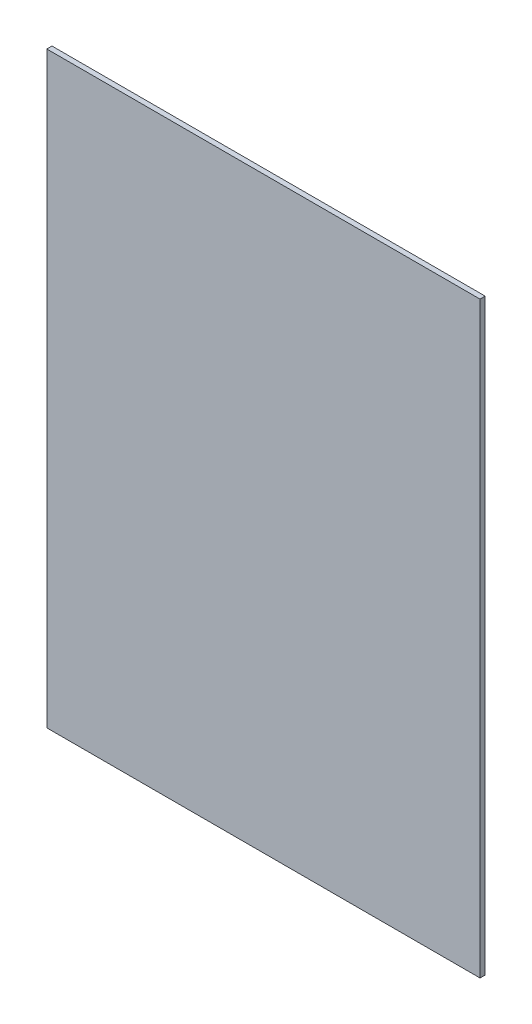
from build123d import *

# Parameters (mm, degrees)
SCHIZZO1_W                   = 840
SCHIZZO1_H                   = 1140
ESTRUSIONE_ESTRUSIONE1_DEPTH = 10


with BuildPart() as part:
    # Schizzo1 → Estrusione-Estrusione1 (new body)
    with BuildSketch(Plane.XY):
        Rectangle(SCHIZZO1_W, SCHIZZO1_H)
    extrude(amount=ESTRUSIONE_ESTRUSIONE1_DEPTH)


solid = part.part
